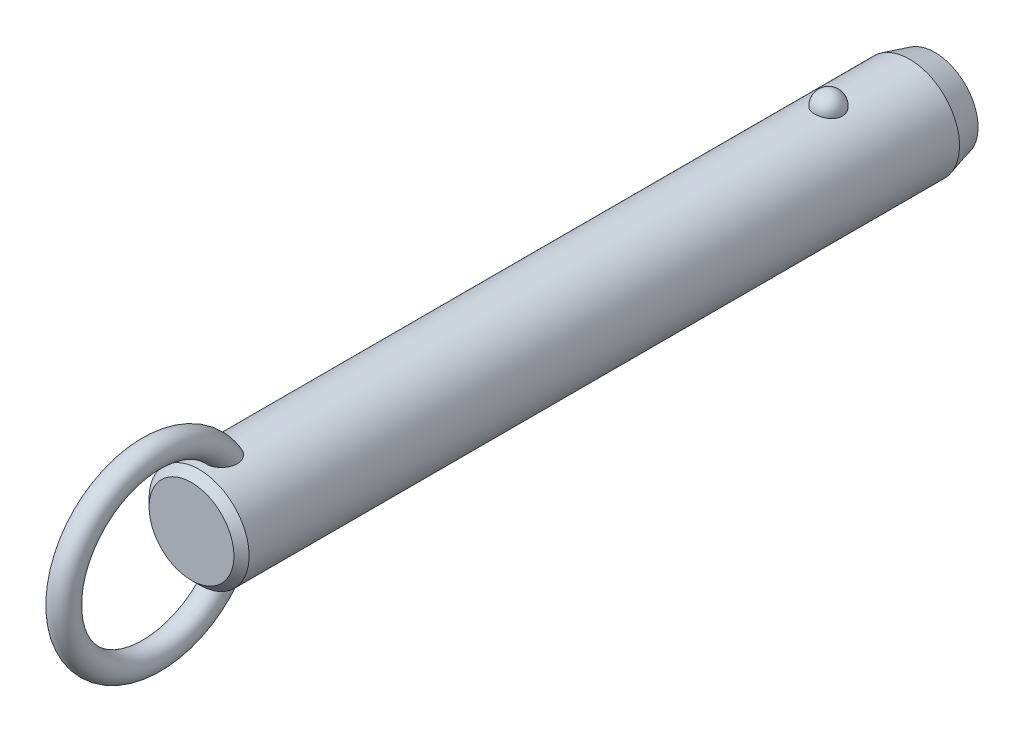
ISO-10303-21;
HEADER;
FILE_DESCRIPTION(('STEP AP214'),'2;1');
FILE_NAME('part.step','',(''),(''),'','','');
FILE_SCHEMA(('AUTOMOTIVE_DESIGN { 1 0 10303 214 1 1 1 1 }'));
ENDSEC;
DATA;
#1=APPLICATION_CONTEXT('core data for automotive mechanical design processes');
#2=APPLICATION_PROTOCOL_DEFINITION('international standard','automotive_design',2000,#1);
#3=PRODUCT_CONTEXT('',#1,'mechanical');
#4=PRODUCT('Part','Part','',(#3));
#5=PRODUCT_RELATED_PRODUCT_CATEGORY('part','',(#4));
#6=PRODUCT_DEFINITION_FORMATION('','',#4);
#7=PRODUCT_DEFINITION_CONTEXT('part definition',#1,'design');
#8=PRODUCT_DEFINITION('design','',#6,#7);
#9=PRODUCT_DEFINITION_SHAPE('','',#8);
#10=(LENGTH_UNIT() NAMED_UNIT(*) SI_UNIT(.MILLI.,.METRE.));
#11=(NAMED_UNIT(*) PLANE_ANGLE_UNIT() SI_UNIT($,.RADIAN.));
#12=(NAMED_UNIT(*) SI_UNIT($,.STERADIAN.) SOLID_ANGLE_UNIT());
#13=UNCERTAINTY_MEASURE_WITH_UNIT(LENGTH_MEASURE(1.E-05),#10,'distance_accuracy_value','');
#14=(GEOMETRIC_REPRESENTATION_CONTEXT(3) GLOBAL_UNCERTAINTY_ASSIGNED_CONTEXT((#13)) GLOBAL_UNIT_ASSIGNED_CONTEXT((#10,
#11,#12)) REPRESENTATION_CONTEXT('',''));
#15=CARTESIAN_POINT('',(0.,0.,0.));
#16=DIRECTION('',(0.,0.,1.));
#17=DIRECTION('',(1.,0.,0.));
#18=AXIS2_PLACEMENT_3D('',#15,#16,#17);
#19=CARTESIAN_POINT('',(0.,0.,88.9));
#20=DIRECTION('',(0.,0.,-1.));
#21=DIRECTION('',(-1.,0.,0.));
#22=AXIS2_PLACEMENT_3D('',#19,#20,#21);
#23=CYLINDRICAL_SURFACE('',#22,7.9);
#24=CARTESIAN_POINT('',(2.1785689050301,7.59367088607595,-2.19999999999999));
#25=CARTESIAN_POINT('',(2.17856679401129,7.59367269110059,-2.07701843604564));
#26=CARTESIAN_POINT('',(2.16853481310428,7.59657145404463,-1.95401006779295));
#27=CARTESIAN_POINT('',(2.12864689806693,7.607843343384,-1.71147811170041));
#28=CARTESIAN_POINT('',(2.09878338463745,7.61621856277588,-1.59195587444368));
#29=CARTESIAN_POINT('',(2.0199931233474,7.63749180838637,-1.3598563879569));
#30=CARTESIAN_POINT('',(1.97107475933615,7.6503878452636,-1.24727610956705));
#31=CARTESIAN_POINT('',(1.85539377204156,7.67926115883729,-1.03213234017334));
#32=CARTESIAN_POINT('',(1.78863158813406,7.69523835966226,-0.929568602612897));
#33=CARTESIAN_POINT('',(1.63856494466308,7.7285848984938,-0.736786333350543));
#34=CARTESIAN_POINT('',(1.55518140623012,7.7459606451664,-0.646630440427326));
#35=CARTESIAN_POINT('',(1.37422937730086,7.78009978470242,-0.481747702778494));
#36=CARTESIAN_POINT('',(1.27666086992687,7.79686317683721,-0.407020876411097));
#37=CARTESIAN_POINT('',(1.07024728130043,7.82786153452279,-0.275278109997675));
#38=CARTESIAN_POINT('',(0.961434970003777,7.84210353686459,-0.218212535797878));
#39=CARTESIAN_POINT('',(0.735351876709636,7.86652194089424,-0.123146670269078));
#40=CARTESIAN_POINT('',(0.618082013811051,7.87669878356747,-0.085144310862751));
#41=CARTESIAN_POINT('',(0.380637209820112,7.89170521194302,-0.0298158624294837));
#42=CARTESIAN_POINT('',(0.260550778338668,7.89662650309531,-0.0121347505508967));
#43=CARTESIAN_POINT('',(0.0190117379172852,7.90090003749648,0.00324379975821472));
#44=CARTESIAN_POINT('',(-0.102440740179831,7.90025280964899,0.00094313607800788));
#45=CARTESIAN_POINT('',(-0.341452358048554,7.89351056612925,-0.0233955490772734));
#46=CARTESIAN_POINT('',(-0.459042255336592,7.88749257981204,-0.0451545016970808));
#47=CARTESIAN_POINT('',(-0.688796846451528,7.87075812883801,-0.107408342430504));
#48=CARTESIAN_POINT('',(-0.800961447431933,7.86004158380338,-0.147903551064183));
#49=CARTESIAN_POINT('',(-1.01743634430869,7.83497131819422,-0.246799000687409));
#50=CARTESIAN_POINT('',(-1.12169791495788,7.82059709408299,-0.305300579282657));
#51=CARTESIAN_POINT('',(-1.31891765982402,7.78976470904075,-0.438549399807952));
#52=CARTESIAN_POINT('',(-1.41187469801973,7.77330633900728,-0.513298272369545));
#53=CARTESIAN_POINT('',(-1.58577142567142,7.73972434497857,-0.678622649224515));
#54=CARTESIAN_POINT('',(-1.66645140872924,7.72259402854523,-0.769470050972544));
#55=CARTESIAN_POINT('',(-1.81161503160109,7.68983776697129,-0.963538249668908));
#56=CARTESIAN_POINT('',(-1.87609753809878,7.6742119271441,-1.06675991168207));
#57=CARTESIAN_POINT('',(-1.98790138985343,7.6460202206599,-1.28401170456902));
#58=CARTESIAN_POINT('',(-2.03501994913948,7.63349104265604,-1.39815107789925));
#59=CARTESIAN_POINT('',(-2.10986724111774,7.6131449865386,-1.63301784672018));
#60=CARTESIAN_POINT('',(-2.1375965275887,7.60532797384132,-1.75374505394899));
#61=CARTESIAN_POINT('',(-2.17289256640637,7.5953195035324,-1.99782562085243));
#62=CARTESIAN_POINT('',(-2.18054294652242,7.59310471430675,-2.12116592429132));
#63=CARTESIAN_POINT('',(-2.17572919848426,7.59448538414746,-2.36741799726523));
#64=CARTESIAN_POINT('',(-2.1632656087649,7.59808068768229,-2.49032977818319));
#65=CARTESIAN_POINT('',(-2.11865035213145,7.61064035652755,-2.73161015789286));
#66=CARTESIAN_POINT('',(-2.08659579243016,7.61957823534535,-2.84999812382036));
#67=CARTESIAN_POINT('',(-2.00367799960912,7.64179982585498,-3.07955956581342));
#68=CARTESIAN_POINT('',(-1.9528140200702,7.65508371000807,-3.19073275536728));
#69=CARTESIAN_POINT('',(-1.83321113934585,7.68460381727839,-3.40337899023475));
#70=CARTESIAN_POINT('',(-1.76437735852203,7.70085556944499,-3.50479651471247));
#71=CARTESIAN_POINT('',(-1.61069526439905,7.73445734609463,-3.69446912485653));
#72=CARTESIAN_POINT('',(-1.52584634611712,7.75180741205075,-3.78272371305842));
#73=CARTESIAN_POINT('',(-1.34198059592,7.78574608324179,-3.94393987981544));
#74=CARTESIAN_POINT('',(-1.24291308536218,7.80233167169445,-4.01684434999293));
#75=CARTESIAN_POINT('',(-1.03352039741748,7.83281625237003,-4.14489386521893));
#76=CARTESIAN_POINT('',(-0.92319600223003,7.84671543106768,-4.20004014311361));
#77=CARTESIAN_POINT('',(-0.695822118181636,7.87011575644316,-4.29042017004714));
#78=CARTESIAN_POINT('',(-0.578872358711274,7.87966903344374,-4.32589112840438));
#79=CARTESIAN_POINT('',(-0.340410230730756,7.8935652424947,-4.37692226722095));
#80=CARTESIAN_POINT('',(-0.218898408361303,7.89790879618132,-4.39248482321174));
#81=CARTESIAN_POINT('',(0.0228107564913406,7.90087453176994,-4.40314405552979));
#82=CARTESIAN_POINT('',(0.142990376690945,7.89960185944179,-4.39861683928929));
#83=CARTESIAN_POINT('',(0.380829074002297,7.89171262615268,-4.37008293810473));
#84=CARTESIAN_POINT('',(0.498488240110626,7.8850962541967,-4.34607694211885));
#85=CARTESIAN_POINT('',(0.727535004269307,7.86726442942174,-4.27939317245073));
#86=CARTESIAN_POINT('',(0.838944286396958,7.85606616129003,-4.236785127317));
#87=CARTESIAN_POINT('',(1.05295421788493,7.83025654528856,-4.13408348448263));
#88=CARTESIAN_POINT('',(1.15555431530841,7.81564498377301,-4.07398879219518));
#89=CARTESIAN_POINT('',(1.35076763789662,7.7843022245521,-3.93687432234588));
#90=CARTESIAN_POINT('',(1.4432046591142,7.76754209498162,-3.85961036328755));
#91=CARTESIAN_POINT('',(1.6139111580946,7.73387857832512,-3.69076949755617));
#92=CARTESIAN_POINT('',(1.6921781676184,7.71697516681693,-3.59919010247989));
#93=CARTESIAN_POINT('',(1.83380875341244,7.6845643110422,-3.40247278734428));
#94=CARTESIAN_POINT('',(1.89689280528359,7.66908588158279,-3.29712873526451));
#95=CARTESIAN_POINT('',(2.0047823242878,7.64159441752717,-3.07707931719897));
#96=CARTESIAN_POINT('',(2.0495945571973,7.62958010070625,-2.96237743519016));
#97=CARTESIAN_POINT('',(2.11580183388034,7.61146617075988,-2.74040519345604));
#98=CARTESIAN_POINT('',(2.13929812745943,7.60484503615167,-2.63379846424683));
#99=CARTESIAN_POINT('',(2.17068242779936,7.59594664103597,-2.41813481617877));
#100=CARTESIAN_POINT('',(2.17857077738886,7.59366928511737,-2.30907795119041));
#101=CARTESIAN_POINT('',(2.1785689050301,7.59367088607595,-2.19999999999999));
#102=B_SPLINE_CURVE_WITH_KNOTS('',3,(#24,#25,#26,#27,#28,#29,#30,#31,#32,#33,#34,#35,#36,#37,
#38,#39,#40,#41,#42,#43,#44,#45,#46,#47,#48,#49,#50,#51,#52,#53,#54,#55,#56,#57,#58,#59,#60,#61,
#62,#63,#64,#65,#66,#67,#68,#69,#70,#71,#72,#73,#74,#75,#76,#77,#78,#79,#80,#81,#82,#83,#84,#85,
#86,#87,#88,#89,#90,#91,#92,#93,#94,#95,#96,#97,#98,#99,#100,#101),.UNSPECIFIED.,.T.,.F.,(4,2,2,
2,2,2,2,2,2,2,2,2,2,2,2,2,2,2,2,2,2,2,2,2,2,2,2,2,2,2,2,2,2,2,2,2,2,2,4),(0.,0.368552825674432,
0.737246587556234,1.10577831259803,1.4743009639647,1.8446206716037,2.21494081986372,
2.5842105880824,2.95344028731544,3.31611630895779,3.67875788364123,4.03628044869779,
4.39380913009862,4.75338791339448,5.11300280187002,5.47939989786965,5.8458226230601,
6.21639834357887,6.58696347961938,6.95598276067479,7.32499216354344,7.69218715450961,
8.0593967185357,8.42858578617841,8.79778880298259,9.16834203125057,9.5388695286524,
9.90482699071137,10.2707407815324,10.6298333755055,10.9889132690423,11.3466585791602,
11.7044262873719,12.0676511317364,12.4309391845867,12.8004764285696,13.1698767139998,
13.4967701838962,13.8236564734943),.UNSPECIFIED.);
#103=CARTESIAN_POINT('',(2.1785689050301,7.59367088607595,-2.19999999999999));
#104=VERTEX_POINT('',#103);
#105=EDGE_CURVE('E41',#104,#104,#102,.T.);
#106=ORIENTED_EDGE('',*,*,#105,.T.);
#107=EDGE_LOOP('',(#106));
#108=FACE_BOUND('',#107,.T.);
#109=CARTESIAN_POINT('',(0.,0.,97.22));
#110=DIRECTION('',(0.,0.,1.));
#111=DIRECTION('',(1.,0.,0.));
#112=AXIS2_PLACEMENT_3D('',#109,#110,#111);
#113=CIRCLE('',#112,7.9);
#114=CARTESIAN_POINT('',(-7.90000000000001,0.,97.22));
#115=VERTEX_POINT('',#114);
#116=EDGE_CURVE('E10',#115,#115,#113,.F.);
#117=ORIENTED_EDGE('',*,*,#116,.T.);
#118=EDGE_LOOP('',(#117));
#119=FACE_BOUND('',#118,.T.);
#120=CARTESIAN_POINT('',(-0.630969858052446,-7.87476203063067,91.1124322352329));
#121=CARTESIAN_POINT('',(-0.73418033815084,-7.8664899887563,91.147285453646));
#122=CARTESIAN_POINT('',(-0.834476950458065,-7.85639291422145,91.1908160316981));
#123=CARTESIAN_POINT('',(-1.02620356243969,-7.83366343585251,91.2940948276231));
#124=CARTESIAN_POINT('',(-1.1176141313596,-7.82102565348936,91.3538775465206));
#125=CARTESIAN_POINT('',(-1.28877277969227,-7.79464922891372,91.4878390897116));
#126=CARTESIAN_POINT('',(-1.36854014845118,-7.78091246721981,91.561993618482));
#127=CARTESIAN_POINT('',(-1.5146152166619,-7.75380398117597,91.7224941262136));
#128=CARTESIAN_POINT('',(-1.58092966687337,-7.74043207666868,91.8088339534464));
#129=CARTESIAN_POINT('',(-1.70019064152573,-7.71512522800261,91.9929784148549));
#130=CARTESIAN_POINT('',(-1.75284037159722,-7.70322473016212,92.0909792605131));
#131=CARTESIAN_POINT('',(-1.84263464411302,-7.68224112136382,92.2941029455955));
#132=CARTESIAN_POINT('',(-1.87977299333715,-7.6731591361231,92.3992286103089));
#133=CARTESIAN_POINT('',(-1.94152728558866,-7.65777930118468,92.6232849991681));
#134=CARTESIAN_POINT('',(-1.96475471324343,-7.65179654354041,92.7426167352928));
#135=CARTESIAN_POINT('',(-1.99449499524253,-7.64409642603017,92.9834298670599));
#136=CARTESIAN_POINT('',(-2.0010005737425,-7.64238092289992,93.1049121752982));
#137=CARTESIAN_POINT('',(-1.99856014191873,-7.64302120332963,93.3683409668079));
#138=CARTESIAN_POINT('',(-1.98680021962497,-7.64611845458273,93.5102565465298));
#139=CARTESIAN_POINT('',(-1.9445777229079,-7.65696186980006,93.7911188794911));
#140=CARTESIAN_POINT('',(-1.91409393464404,-7.66471330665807,93.9300620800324));
#141=CARTESIAN_POINT('',(-1.82768670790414,-7.68582947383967,94.231939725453));
#142=CARTESIAN_POINT('',(-1.76772963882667,-7.70003779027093,94.393686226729));
#143=CARTESIAN_POINT('',(-1.65998501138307,-7.72371550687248,94.6276956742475));
#144=CARTESIAN_POINT('',(-1.621079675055,-7.73200670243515,94.7042974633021));
#145=CARTESIAN_POINT('',(-1.53727726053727,-7.74910377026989,94.8540798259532));
#146=CARTESIAN_POINT('',(-1.49238215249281,-7.75790947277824,94.9272615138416));
#147=CARTESIAN_POINT('',(-1.3739705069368,-7.77993338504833,95.1028838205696));
#148=CARTESIAN_POINT('',(-1.29690364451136,-7.79328473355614,95.2029557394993));
#149=CARTESIAN_POINT('',(-1.1288548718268,-7.81939266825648,95.3907147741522));
#150=CARTESIAN_POINT('',(-1.03789926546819,-7.83215032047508,95.4784247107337));
#151=CARTESIAN_POINT('',(-0.869532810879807,-7.85231710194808,95.6134148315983));
#152=CARTESIAN_POINT('',(-0.795716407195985,-7.86021093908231,95.665076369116));
#153=CARTESIAN_POINT('',(-0.64081313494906,-7.87434920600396,95.7563815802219));
#154=CARTESIAN_POINT('',(-0.55973779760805,-7.88059619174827,95.7960438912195));
#155=CARTESIAN_POINT('',(-0.406456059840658,-7.88984116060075,95.8543008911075));
#156=CARTESIAN_POINT('',(-0.335227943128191,-7.89321892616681,95.8753848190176));
#157=CARTESIAN_POINT('',(-0.19019307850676,-7.89804235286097,95.9054141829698));
#158=CARTESIAN_POINT('',(-0.11638863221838,-7.89948969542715,95.9143701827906));
#159=CARTESIAN_POINT('',(0.0318414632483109,-7.90028409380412,95.9192915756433));
#160=CARTESIAN_POINT('',(0.106268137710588,-7.89962640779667,95.9152276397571));
#161=CARTESIAN_POINT('',(0.253290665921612,-7.8962818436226,95.8944615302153));
#162=CARTESIAN_POINT('',(0.32588518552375,-7.8935935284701,95.8777504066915));
#163=CARTESIAN_POINT('',(0.481441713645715,-7.88577340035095,95.8287380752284));
#164=CARTESIAN_POINT('',(0.563611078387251,-7.88026321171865,95.794005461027));
#165=CARTESIAN_POINT('',(0.721129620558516,-7.86741729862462,95.7117965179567));
#166=CARTESIAN_POINT('',(0.796466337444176,-7.86007832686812,95.6642975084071));
#167=CARTESIAN_POINT('',(0.971456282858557,-7.84073285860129,95.536513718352));
#168=CARTESIAN_POINT('',(1.0671968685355,-7.82809461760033,95.4510047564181));
#169=CARTESIAN_POINT('',(1.24418921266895,-7.80192439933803,95.266232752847));
#170=CARTESIAN_POINT('',(1.32540832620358,-7.78839049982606,95.1669395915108));
#171=CARTESIAN_POINT('',(1.45199971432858,-7.76559693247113,94.9895760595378));
#172=CARTESIAN_POINT('',(1.50085649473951,-7.75626094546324,94.9139542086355));
#173=CARTESIAN_POINT('',(1.59197749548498,-7.7380727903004,94.7587428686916));
#174=CARTESIAN_POINT('',(1.63423919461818,-7.72922080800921,94.6791518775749));
#175=CARTESIAN_POINT('',(1.71222612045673,-7.71231959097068,94.5166640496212));
#176=CARTESIAN_POINT('',(1.74794516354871,-7.70427111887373,94.4337641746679));
#177=CARTESIAN_POINT('',(1.81270113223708,-7.68929240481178,94.2652967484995));
#178=CARTESIAN_POINT('',(1.84173789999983,-7.68236218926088,94.1797291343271));
#179=CARTESIAN_POINT('',(1.89322698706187,-7.6698375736,94.0052870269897));
#180=CARTESIAN_POINT('',(1.91558744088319,-7.66426199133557,93.9163838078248));
#181=CARTESIAN_POINT('',(1.95281367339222,-7.65485915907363,93.7369696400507));
#182=CARTESIAN_POINT('',(1.96767946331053,-7.65103190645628,93.6464586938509));
#183=CARTESIAN_POINT('',(2.00021456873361,-7.64262981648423,93.3737320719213));
#184=CARTESIAN_POINT('',(2.00600691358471,-7.6410871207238,93.1897099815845));
#185=CARTESIAN_POINT('',(1.98445334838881,-7.64669564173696,92.8765019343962));
#186=CARTESIAN_POINT('',(1.96607186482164,-7.65149688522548,92.7466189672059));
#187=CARTESIAN_POINT('',(1.90884967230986,-7.6659762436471,92.4916321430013));
#188=CARTESIAN_POINT('',(1.8700210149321,-7.67565148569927,92.366525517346));
#189=CARTESIAN_POINT('',(1.77063986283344,-7.69918471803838,92.1245401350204));
#190=CARTESIAN_POINT('',(1.70993724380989,-7.71307150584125,92.0077250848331));
#191=CARTESIAN_POINT('',(1.5673307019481,-7.74330306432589,91.7881444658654));
#192=CARTESIAN_POINT('',(1.48543692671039,-7.75964665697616,91.6853722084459));
#193=CARTESIAN_POINT('',(1.31346177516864,-7.79047523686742,91.5093800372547));
#194=CARTESIAN_POINT('',(1.22547278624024,-7.80495298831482,91.4341066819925));
#195=CARTESIAN_POINT('',(1.03724352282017,-7.83218597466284,91.3004864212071));
#196=CARTESIAN_POINT('',(0.937008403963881,-7.84494192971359,91.2421324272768));
#197=CARTESIAN_POINT('',(0.733599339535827,-7.86649045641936,91.1470270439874));
#198=CARTESIAN_POINT('',(0.630941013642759,-7.87547134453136,91.1092109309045));
#199=CARTESIAN_POINT('',(0.420465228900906,-7.88950708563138,91.0511160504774));
#200=CARTESIAN_POINT('',(0.312645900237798,-7.89456050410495,91.0308436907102));
#201=CARTESIAN_POINT('',(0.0960869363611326,-7.9001518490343,91.0084559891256));
#202=CARTESIAN_POINT('',(-0.0126341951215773,-7.90073226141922,91.0061698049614));
#203=CARTESIAN_POINT('',(-0.228766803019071,-7.89742350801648,91.0193678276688));
#204=CARTESIAN_POINT('',(-0.336180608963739,-7.89354403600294,91.0348134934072));
#205=CARTESIAN_POINT('',(-0.473410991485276,-7.88586871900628,91.0662177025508));
#206=CARTESIAN_POINT('',(-0.50525779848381,-7.88388984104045,91.0743541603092));
#207=CARTESIAN_POINT('',(-0.5684812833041,-7.87958326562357,91.0922083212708));
#208=CARTESIAN_POINT('',(-0.599857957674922,-7.87725556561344,91.1019260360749));
#209=CARTESIAN_POINT('',(-0.630969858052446,-7.87476203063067,91.1124322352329));
#210=B_SPLINE_CURVE_WITH_KNOTS('',3,(#120,#121,#122,#123,#124,#125,#126,#127,#128,#129,#130,
#131,#132,#133,#134,#135,#136,#137,#138,#139,#140,#141,#142,#143,#144,#145,#146,#147,#148,#149,
#150,#151,#152,#153,#154,#155,#156,#157,#158,#159,#160,#161,#162,#163,#164,#165,#166,#167,#168,
#169,#170,#171,#172,#173,#174,#175,#176,#177,#178,#179,#180,#181,#182,#183,#184,#185,#186,#187,
#188,#189,#190,#191,#192,#193,#194,#195,#196,#197,#198,#199,#200,#201,#202,#203,#204,#205,#206,
#207,#208,#209),.UNSPECIFIED.,.T.,.F.,(4,2,2,2,2,2,2,2,2,2,2,2,2,2,2,2,2,2,2,2,2,2,2,2,2,2,2,2,
2,2,2,2,2,2,2,2,2,2,2,2,2,2,2,2,4),(0.,0.327622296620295,0.655945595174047,0.983718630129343,
1.3113267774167,1.64554655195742,1.9798996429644,2.3436572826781,2.70757317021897,
3.13333684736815,3.55958380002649,4.07655306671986,4.3352789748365,4.59391999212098,
4.97382437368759,5.35301797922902,5.62348245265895,5.89352465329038,6.11565959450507,
6.3376009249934,6.56004255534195,6.78264174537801,7.04930844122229,7.31645206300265,
7.70130871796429,8.08701995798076,8.35824509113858,8.62957365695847,8.90115735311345,
9.17274746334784,9.44791855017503,9.72308922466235,10.2715298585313,10.6638393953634,
11.0559179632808,11.4507403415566,11.845374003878,12.1936425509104,12.5417649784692,
12.8695063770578,13.1973674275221,13.5221104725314,13.8461490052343,13.9449071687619,
14.0436660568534),.UNSPECIFIED.);
#211=CARTESIAN_POINT('',(-0.630969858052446,-7.87476203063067,91.1124322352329));
#212=VERTEX_POINT('',#211);
#213=EDGE_CURVE('E60',#212,#212,#210,.T.);
#214=ORIENTED_EDGE('',*,*,#213,.T.);
#215=EDGE_LOOP('',(#214));
#216=FACE_BOUND('',#215,.T.);
#217=CARTESIAN_POINT('',(-0.630969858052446,7.87476203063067,91.1124322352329));
#218=CARTESIAN_POINT('',(-0.528918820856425,7.88293636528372,91.0779798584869));
#219=CARTESIAN_POINT('',(-0.423745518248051,7.8893481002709,91.051915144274));
#220=CARTESIAN_POINT('',(-0.210236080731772,7.8979273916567,91.0172825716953));
#221=CARTESIAN_POINT('',(-0.10189380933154,7.90008607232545,91.0087513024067));
#222=CARTESIAN_POINT('',(0.114660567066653,7.89990877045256,91.0094570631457));
#223=CARTESIAN_POINT('',(0.222872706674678,7.89757640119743,91.0186798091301));
#224=CARTESIAN_POINT('',(0.436107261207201,7.88867538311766,91.0546525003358));
#225=CARTESIAN_POINT('',(0.541131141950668,7.8821087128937,91.0813942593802));
#226=CARTESIAN_POINT('',(0.745085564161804,7.86545130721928,91.1517561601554));
#227=CARTESIAN_POINT('',(0.844015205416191,7.85536005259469,91.1953787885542));
#228=CARTESIAN_POINT('',(1.03299167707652,7.83275153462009,91.2983796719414));
#229=CARTESIAN_POINT('',(1.12303841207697,7.8202342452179,91.3577580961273));
#230=CARTESIAN_POINT('',(1.29214734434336,7.79408219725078,91.4908647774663));
#231=CARTESIAN_POINT('',(1.37116907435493,7.78044359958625,91.5646436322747));
#232=CARTESIAN_POINT('',(1.51597677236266,7.75353170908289,91.7242353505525));
#233=CARTESIAN_POINT('',(1.58176261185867,7.74025841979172,91.8100483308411));
#234=CARTESIAN_POINT('',(1.70057386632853,7.71504069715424,91.993644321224));
#235=CARTESIAN_POINT('',(1.75320073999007,7.70314257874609,92.0916906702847));
#236=CARTESIAN_POINT('',(1.84293767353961,7.68216822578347,92.2948931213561));
#237=CARTESIAN_POINT('',(1.88004278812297,7.67309289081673,92.4000514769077));
#238=CARTESIAN_POINT('',(1.9417232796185,7.6577294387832,92.6241671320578));
#239=CARTESIAN_POINT('',(1.96491037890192,7.65175648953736,92.7435248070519));
#240=CARTESIAN_POINT('',(1.9945689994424,7.64407702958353,92.9843848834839));
#241=CARTESIAN_POINT('',(2.00103304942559,7.64237242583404,93.1058882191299));
#242=CARTESIAN_POINT('',(1.9985016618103,7.64303650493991,93.3693688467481));
#243=CARTESIAN_POINT('',(1.98669038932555,7.64614714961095,93.5113141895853));
#244=CARTESIAN_POINT('',(1.94436120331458,7.6570170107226,93.7922287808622));
#245=CARTESIAN_POINT('',(1.91382203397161,7.66478150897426,93.9311944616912));
#246=CARTESIAN_POINT('',(1.82728754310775,7.68592483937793,94.2331110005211));
#247=CARTESIAN_POINT('',(1.76725778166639,7.7001468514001,94.394872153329));
#248=CARTESIAN_POINT('',(1.65939700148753,7.72384204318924,94.6288914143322));
#249=CARTESIAN_POINT('',(1.62045187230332,7.73213852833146,94.7054942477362));
#250=CARTESIAN_POINT('',(1.53656684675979,7.74924489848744,94.8552737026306));
#251=CARTESIAN_POINT('',(1.49162892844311,7.75805461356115,94.9284514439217));
#252=CARTESIAN_POINT('',(1.37317698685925,7.78007342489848,95.1039520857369));
#253=CARTESIAN_POINT('',(1.29612360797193,7.79341423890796,95.2039112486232));
#254=CARTESIAN_POINT('',(1.12812043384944,7.81949839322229,95.3914508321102));
#255=CARTESIAN_POINT('',(1.03719688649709,7.83224280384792,95.4790540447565));
#256=CARTESIAN_POINT('',(0.868871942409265,7.85239026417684,95.6138971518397));
#257=CARTESIAN_POINT('',(0.795056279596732,7.86027769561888,95.6655113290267));
#258=CARTESIAN_POINT('',(0.640160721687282,7.87440222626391,95.7567201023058));
#259=CARTESIAN_POINT('',(0.559092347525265,7.88064188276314,95.7963333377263));
#260=CARTESIAN_POINT('',(0.405820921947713,7.8898738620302,95.8545056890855));
#261=CARTESIAN_POINT('',(0.334594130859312,7.89324577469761,95.8755523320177));
#262=CARTESIAN_POINT('',(0.189568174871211,7.89805733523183,95.9055070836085));
#263=CARTESIAN_POINT('',(0.115771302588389,7.89949866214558,95.9144257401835));
#264=CARTESIAN_POINT('',(-0.0324359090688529,7.90028156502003,95.9192758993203));
#265=CARTESIAN_POINT('',(-0.106847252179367,7.89961843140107,95.9151782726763));
#266=CARTESIAN_POINT('',(-0.253834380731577,7.8962642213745,95.8943519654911));
#267=CARTESIAN_POINT('',(-0.326408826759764,7.89357170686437,95.8776143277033));
#268=CARTESIAN_POINT('',(-0.481962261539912,7.88574179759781,95.8285391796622));
#269=CARTESIAN_POINT('',(-0.564145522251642,7.88022507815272,95.7937638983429));
#270=CARTESIAN_POINT('',(-0.721685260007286,7.86736646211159,95.7114686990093));
#271=CARTESIAN_POINT('',(-0.797029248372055,7.8600213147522,95.6639260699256));
#272=CARTESIAN_POINT('',(-0.972044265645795,7.84066026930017,95.5360267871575));
#273=CARTESIAN_POINT('',(-1.06779803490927,7.82801274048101,95.4504436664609));
#274=CARTESIAN_POINT('',(-1.24480531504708,7.80182621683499,95.2655223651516));
#275=CARTESIAN_POINT('',(-1.32602618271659,7.78828530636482,95.1661540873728));
#276=CARTESIAN_POINT('',(-1.45259834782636,7.76548487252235,94.9886806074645));
#277=CARTESIAN_POINT('',(-1.50143856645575,7.75614818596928,94.9130252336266));
#278=CARTESIAN_POINT('',(-1.59252410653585,7.73796020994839,94.7577484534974));
#279=CARTESIAN_POINT('',(-1.63476690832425,7.72910910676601,94.6781255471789));
#280=CARTESIAN_POINT('',(-1.71271318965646,7.71221133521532,94.5155750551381));
#281=CARTESIAN_POINT('',(-1.74841047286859,7.70416543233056,94.4326444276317));
#282=CARTESIAN_POINT('',(-1.81311929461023,7.6891937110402,94.2641168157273));
#283=CARTESIAN_POINT('',(-1.84213067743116,7.6822679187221,94.1785197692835));
#284=CARTESIAN_POINT('',(-1.89356259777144,7.66975461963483,94.0040254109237));
#285=CARTESIAN_POINT('',(-1.91589165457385,7.66418586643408,93.9150995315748));
#286=CARTESIAN_POINT('',(-1.95305070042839,7.65479859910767,93.7356424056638));
#287=CARTESIAN_POINT('',(-1.96788069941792,7.65098008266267,93.6451111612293));
#288=CARTESIAN_POINT('',(-2.00030078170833,7.64260704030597,93.3723270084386));
#289=CARTESIAN_POINT('',(-2.00600576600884,7.64108760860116,93.1882718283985));
#290=CARTESIAN_POINT('',(-1.98428483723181,7.64673945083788,92.8750800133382));
#291=CARTESIAN_POINT('',(-1.96583698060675,7.6515575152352,92.7452400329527));
#292=CARTESIAN_POINT('',(-1.90848948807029,7.66606613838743,92.4903619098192));
#293=CARTESIAN_POINT('',(-1.86960376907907,7.67575338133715,92.365320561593));
#294=CARTESIAN_POINT('',(-1.7701342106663,7.69930132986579,92.1235009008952));
#295=CARTESIAN_POINT('',(-1.70940488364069,7.71318991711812,92.0067844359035));
#296=CARTESIAN_POINT('',(-1.56672953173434,7.74342495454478,91.7873404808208));
#297=CARTESIAN_POINT('',(-1.48478316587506,7.75977144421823,91.6846132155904));
#298=CARTESIAN_POINT('',(-1.31266325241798,7.79061163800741,91.5086431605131));
#299=CARTESIAN_POINT('',(-1.22456383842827,7.80509908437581,91.4333589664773));
#300=CARTESIAN_POINT('',(-1.03622400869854,7.83231881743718,91.2998659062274));
#301=CARTESIAN_POINT('',(-0.936015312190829,7.84505551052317,91.2416137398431));
#302=CARTESIAN_POINT('',(-0.798824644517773,7.85957802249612,91.1775408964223));
#303=CARTESIAN_POINT('',(-0.765787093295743,7.86286821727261,91.1632248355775));
#304=CARTESIAN_POINT('',(-0.698939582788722,7.86909211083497,91.136436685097));
#305=CARTESIAN_POINT('',(-0.66512963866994,7.8720258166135,91.1239645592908));
#306=CARTESIAN_POINT('',(-0.630969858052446,7.87476203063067,91.1124322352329));
#307=B_SPLINE_CURVE_WITH_KNOTS('',3,(#217,#218,#219,#220,#221,#222,#223,#224,#225,#226,#227,
#228,#229,#230,#231,#232,#233,#234,#235,#236,#237,#238,#239,#240,#241,#242,#243,#244,#245,#246,
#247,#248,#249,#250,#251,#252,#253,#254,#255,#256,#257,#258,#259,#260,#261,#262,#263,#264,#265,
#266,#267,#268,#269,#270,#271,#272,#273,#274,#275,#276,#277,#278,#279,#280,#281,#282,#283,#284,
#285,#286,#287,#288,#289,#290,#291,#292,#293,#294,#295,#296,#297,#298,#299,#300,#301,#302,#303,
#304,#305,#306),.UNSPECIFIED.,.T.,.F.,(4,2,2,2,2,2,2,2,2,2,2,2,2,2,2,2,2,2,2,2,2,2,2,2,2,2,2,2,
2,2,2,2,2,2,2,2,2,2,2,2,2,2,2,2,4),(0.,0.323920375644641,0.648516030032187,0.97285063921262,
1.29703380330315,1.62126473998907,1.94549915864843,2.27089401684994,2.5962920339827,
2.93059633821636,3.26500707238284,3.62881644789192,3.99278833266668,4.41865421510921,
4.84500434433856,5.36209210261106,5.62087589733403,5.87957448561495,6.25918598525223,
6.63808782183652,6.90846748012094,7.17842501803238,7.40052350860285,7.62242871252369,
7.84483086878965,8.06739077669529,8.33414615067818,8.60137921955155,8.98641454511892,
9.3723041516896,9.64358673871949,9.91497268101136,10.1866142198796,10.4582620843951,
10.7334745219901,11.0086865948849,11.5572126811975,11.9494246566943,12.3413699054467,
12.7359755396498,13.1305875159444,13.4791770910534,13.82687259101,13.9353013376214,
14.0437279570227),.UNSPECIFIED.);
#308=CARTESIAN_POINT('',(-0.630969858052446,7.87476203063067,91.1124322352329));
#309=VERTEX_POINT('',#308);
#310=EDGE_CURVE('E67',#309,#309,#307,.T.);
#311=ORIENTED_EDGE('',*,*,#310,.T.);
#312=EDGE_LOOP('',(#311));
#313=FACE_BOUND('',#312,.T.);
#314=CARTESIAN_POINT('',(0.,0.,-15.));
#315=DIRECTION('',(0.,0.,-1.));
#316=DIRECTION('',(-1.,0.,0.));
#317=AXIS2_PLACEMENT_3D('',#314,#315,#316);
#318=CIRCLE('',#317,7.9);
#319=CARTESIAN_POINT('',(-7.9,0.,-15.));
#320=VERTEX_POINT('',#319);
#321=EDGE_CURVE('E57',#320,#320,#318,.F.);
#322=ORIENTED_EDGE('',*,*,#321,.T.);
#323=EDGE_LOOP('',(#322));
#324=FACE_BOUND('',#323,.T.);
#325=ADVANCED_FACE('F37',(#108,#119,#216,#313,#324),#23,.T.);
#326=CARTESIAN_POINT('',(0.,0.,-19.));
#327=DIRECTION('',(0.,0.,-1.));
#328=DIRECTION('',(-1.,0.,0.));
#329=AXIS2_PLACEMENT_3D('',#326,#327,#328);
#330=PLANE('',#329);
#331=CARTESIAN_POINT('',(0.,0.,-19.));
#332=DIRECTION('',(0.,0.,-1.));
#333=DIRECTION('',(-1.,0.,0.));
#334=AXIS2_PLACEMENT_3D('',#331,#332,#333);
#335=CIRCLE('',#334,6.82820323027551);
#336=CARTESIAN_POINT('',(-6.82820323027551,0.,-19.));
#337=VERTEX_POINT('',#336);
#338=EDGE_CURVE('E66',#337,#337,#335,.T.);
#339=ORIENTED_EDGE('',*,*,#338,.T.);
#340=EDGE_LOOP('',(#339));
#341=FACE_BOUND('',#340,.T.);
#342=ADVANCED_FACE('F85',(#341),#330,.T.);
#343=CARTESIAN_POINT('',(0.,0.,-19.));
#344=DIRECTION('',(0.,0.,1.));
#345=DIRECTION('',(1.,0.,0.));
#346=AXIS2_PLACEMENT_3D('',#343,#344,#345);
#347=CONICAL_SURFACE('',#346,6.82820323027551,0.261799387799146);
#348=ORIENTED_EDGE('',*,*,#321,.F.);
#349=EDGE_LOOP('',(#348));
#350=FACE_BOUND('',#349,.T.);
#351=ORIENTED_EDGE('',*,*,#338,.F.);
#352=EDGE_LOOP('',(#351));
#353=FACE_BOUND('',#352,.T.);
#354=ADVANCED_FACE('F83',(#350,#353),#347,.T.);
#355=CARTESIAN_POINT('',(0.,0.,98.42));
#356=DIRECTION('',(0.,0.,1.));
#357=DIRECTION('',(1.,0.,0.));
#358=AXIS2_PLACEMENT_3D('',#355,#356,#357);
#359=PLANE('',#358);
#360=CARTESIAN_POINT('',(0.,0.,98.42));
#361=DIRECTION('',(0.,0.,1.));
#362=DIRECTION('',(1.,0.,0.));
#363=AXIS2_PLACEMENT_3D('',#360,#361,#362);
#364=CIRCLE('',#363,6.69999999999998);
#365=CARTESIAN_POINT('',(-6.69999999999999,0.,98.42));
#366=VERTEX_POINT('',#365);
#367=EDGE_CURVE('E50',#366,#366,#364,.T.);
#368=ORIENTED_EDGE('',*,*,#367,.T.);
#369=EDGE_LOOP('',(#368));
#370=FACE_BOUND('',#369,.T.);
#371=ADVANCED_FACE('F77',(#370),#359,.T.);
#372=CARTESIAN_POINT('',(0.,0.,104.75));
#373=DIRECTION('',(1.,0.,0.));
#374=DIRECTION('',(0.,0.,-1.));
#375=AXIS2_PLACEMENT_3D('',#372,#373,#374);
#376=TOROIDAL_SURFACE('',#375,13.85,2.);
#377=ORIENTED_EDGE('',*,*,#310,.F.);
#378=EDGE_LOOP('',(#377));
#379=FACE_BOUND('',#378,.T.);
#380=ORIENTED_EDGE('',*,*,#213,.F.);
#381=EDGE_LOOP('',(#380));
#382=FACE_BOUND('',#381,.T.);
#383=ADVANCED_FACE('F73',(#379,#382),#376,.T.);
#384=CARTESIAN_POINT('',(0.,0.,98.42));
#385=DIRECTION('',(0.,0.,-1.));
#386=DIRECTION('',(-1.,0.,0.));
#387=AXIS2_PLACEMENT_3D('',#384,#385,#386);
#388=CONICAL_SURFACE('',#387,6.69999999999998,0.785398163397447);
#389=CARTESIAN_POINT('',(-7.90000000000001,0.,97.22));
#390=CARTESIAN_POINT('',(-7.88750000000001,0.,97.2325));
#391=CARTESIAN_POINT('',(-7.87500000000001,0.,97.245));
#392=CARTESIAN_POINT('',(-7.85,0.,97.27));
#393=CARTESIAN_POINT('',(-7.8375,0.,97.2825));
#394=CARTESIAN_POINT('',(-7.81250000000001,0.,97.3075));
#395=CARTESIAN_POINT('',(-7.80000000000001,0.,97.32));
#396=CARTESIAN_POINT('',(-7.77500000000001,0.,97.345));
#397=CARTESIAN_POINT('',(-7.76250000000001,0.,97.3575));
#398=CARTESIAN_POINT('',(-7.7375,0.,97.3825));
#399=CARTESIAN_POINT('',(-7.725,0.,97.395));
#400=CARTESIAN_POINT('',(-7.7,0.,97.42));
#401=CARTESIAN_POINT('',(-7.68750000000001,0.,97.4325));
#402=CARTESIAN_POINT('',(-7.66250000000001,0.,97.4575));
#403=CARTESIAN_POINT('',(-7.65,0.,97.47));
#404=CARTESIAN_POINT('',(-7.625,0.,97.495));
#405=CARTESIAN_POINT('',(-7.6125,0.,97.5075));
#406=CARTESIAN_POINT('',(-7.5875,0.,97.5325));
#407=CARTESIAN_POINT('',(-7.575,0.,97.545));
#408=CARTESIAN_POINT('',(-7.55,0.,97.57));
#409=CARTESIAN_POINT('',(-7.5375,0.,97.5825));
#410=CARTESIAN_POINT('',(-7.5125,0.,97.6075));
#411=CARTESIAN_POINT('',(-7.5,0.,97.62));
#412=CARTESIAN_POINT('',(-7.475,0.,97.645));
#413=CARTESIAN_POINT('',(-7.4625,0.,97.6575));
#414=CARTESIAN_POINT('',(-7.4375,0.,97.6825));
#415=CARTESIAN_POINT('',(-7.425,0.,97.695));
#416=CARTESIAN_POINT('',(-7.4,0.,97.72));
#417=CARTESIAN_POINT('',(-7.3875,0.,97.7325));
#418=CARTESIAN_POINT('',(-7.3625,0.,97.7575));
#419=CARTESIAN_POINT('',(-7.35,0.,97.77));
#420=CARTESIAN_POINT('',(-7.325,0.,97.795));
#421=CARTESIAN_POINT('',(-7.3125,0.,97.8075));
#422=CARTESIAN_POINT('',(-7.2875,0.,97.8325));
#423=CARTESIAN_POINT('',(-7.275,0.,97.845));
#424=CARTESIAN_POINT('',(-7.25,0.,97.87));
#425=CARTESIAN_POINT('',(-7.2375,0.,97.8825));
#426=CARTESIAN_POINT('',(-7.2125,0.,97.9075));
#427=CARTESIAN_POINT('',(-7.2,0.,97.92));
#428=CARTESIAN_POINT('',(-7.175,0.,97.945));
#429=CARTESIAN_POINT('',(-7.1625,0.,97.9575));
#430=CARTESIAN_POINT('',(-7.1375,0.,97.9825));
#431=CARTESIAN_POINT('',(-7.125,0.,97.995));
#432=CARTESIAN_POINT('',(-7.1,0.,98.02));
#433=CARTESIAN_POINT('',(-7.0875,0.,98.0325));
#434=CARTESIAN_POINT('',(-7.06249999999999,0.,98.0575));
#435=CARTESIAN_POINT('',(-7.04999999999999,0.,98.07));
#436=CARTESIAN_POINT('',(-7.02499999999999,0.,98.095));
#437=CARTESIAN_POINT('',(-7.0125,0.,98.1075));
#438=CARTESIAN_POINT('',(-6.9875,0.,98.1325));
#439=CARTESIAN_POINT('',(-6.975,0.,98.145));
#440=CARTESIAN_POINT('',(-6.94999999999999,0.,98.17));
#441=CARTESIAN_POINT('',(-6.93749999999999,0.,98.1825));
#442=CARTESIAN_POINT('',(-6.91249999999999,0.,98.2075));
#443=CARTESIAN_POINT('',(-6.9,0.,98.22));
#444=CARTESIAN_POINT('',(-6.87499999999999,0.,98.245));
#445=CARTESIAN_POINT('',(-6.86249999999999,0.,98.2575));
#446=CARTESIAN_POINT('',(-6.83749999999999,0.,98.2825));
#447=CARTESIAN_POINT('',(-6.82499999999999,0.,98.295));
#448=CARTESIAN_POINT('',(-6.79999999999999,0.,98.32));
#449=CARTESIAN_POINT('',(-6.78749999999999,0.,98.3325));
#450=CARTESIAN_POINT('',(-6.76249999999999,0.,98.3575));
#451=CARTESIAN_POINT('',(-6.74999999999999,0.,98.37));
#452=CARTESIAN_POINT('',(-6.72499999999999,0.,98.395));
#453=CARTESIAN_POINT('',(-6.71249999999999,0.,98.4075));
#454=CARTESIAN_POINT('',(-6.69999999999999,0.,98.42));
#455=B_SPLINE_CURVE_WITH_KNOTS('',3,(#389,#390,#391,#392,#393,#394,#395,#396,#397,#398,#399,
#400,#401,#402,#403,#404,#405,#406,#407,#408,#409,#410,#411,#412,#413,#414,#415,#416,#417,#418,
#419,#420,#421,#422,#423,#424,#425,#426,#427,#428,#429,#430,#431,#432,#433,#434,#435,#436,#437,
#438,#439,#440,#441,#442,#443,#444,#445,#446,#447,#448,#449,#450,#451,#452,#453,#454),
.UNSPECIFIED.,.F.,.F.,(4,2,2,2,2,2,2,2,2,2,2,2,2,2,2,2,2,2,2,2,2,2,2,2,2,2,2,2,2,2,2,2,4),(0.,
0.0530330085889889,0.106066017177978,0.159099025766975,0.212132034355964,0.265165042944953,
0.318198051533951,0.37123106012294,0.424264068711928,0.477297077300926,0.530330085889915,
0.583363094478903,0.636396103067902,0.68942911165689,0.742462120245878,0.795495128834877,
0.848528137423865,0.901561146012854,0.954594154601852,1.00762716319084,1.06066017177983,
1.11369318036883,1.16672618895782,1.2197591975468,1.2727922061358,1.32582521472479,
1.37885822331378,1.43189123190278,1.48492424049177,1.53795724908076,1.59099025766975,
1.64402326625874,1.69705627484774),.UNSPECIFIED.);
#456=EDGE_CURVE('BSEAM39',#115,#366,#455,.T.);
#457=ORIENTED_EDGE('',*,*,#116,.F.);
#458=ORIENTED_EDGE('',*,*,#367,.F.);
#459=ORIENTED_EDGE('',*,*,#456,.T.);
#460=ORIENTED_EDGE('',*,*,#456,.F.);
#461=EDGE_LOOP('',(#457,#459,#458,#460));
#462=FACE_BOUND('',#461,.T.);
#463=ADVANCED_FACE('F39',(#462),#388,.T.);
#464=CARTESIAN_POINT('',(0.,7.9,-2.19999999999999));
#465=DIRECTION('',(0.,1.,0.));
#466=DIRECTION('',(0.,0.,-1.));
#467=AXIS2_PLACEMENT_3D('',#464,#465,#466);
#468=SPHERICAL_SURFACE('',#467,2.2);
#469=ORIENTED_EDGE('',*,*,#105,.F.);
#470=EDGE_LOOP('',(#469));
#471=FACE_BOUND('',#470,.T.);
#472=ADVANCED_FACE('F79',(#471),#468,.T.);
#473=CLOSED_SHELL('',(#325,#342,#354,#371,#383,#463,#472));
#474=MANIFOLD_SOLID_BREP('B2',#473);
#475=ADVANCED_BREP_SHAPE_REPRESENTATION('',(#18,#474),#14);
#476=SHAPE_DEFINITION_REPRESENTATION(#9,#475);
ENDSEC;
END-ISO-10303-21;
